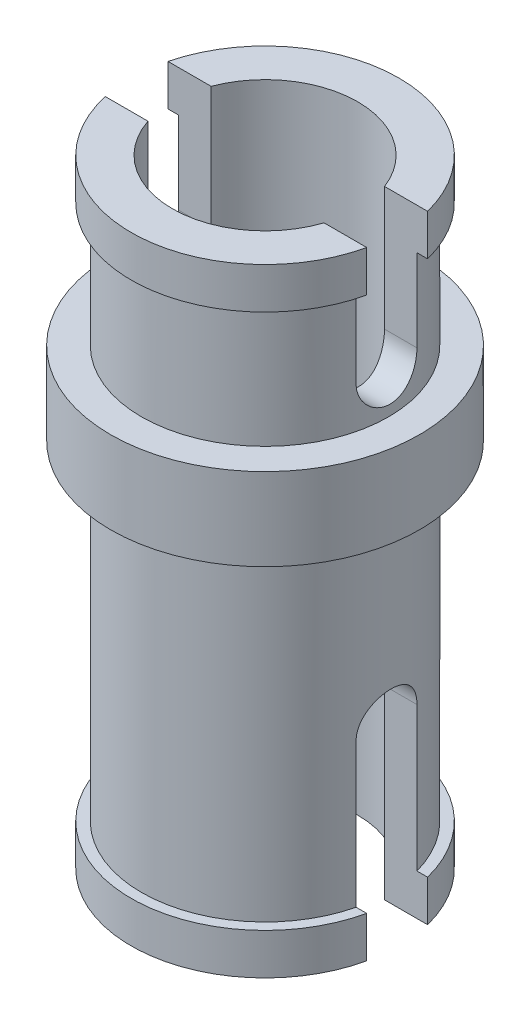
from build123d import *

# Parameters (mm, degrees)
BOSS_EXTRUDE1_DEPTH            = 8
BOSS_EXTRUDE1_DEPTH_BACK       = 8
SKETCH1_R                      = 2.4
BOSS_EXTRUDE2_DEPTH            = 0.8
BOSS_EXTRUDE2_DEPTH_BACK       = 0.8
SKETCH2_R                      = 3
SKETCH4_R                      = 2.6
BOSS_EXTRUDE3_DEPTH            = 0.8
BOSS_EXTRUDE5_START            = -0.8
SKETCH6_R                      = 2.6
BOSS_EXTRUDE5_DEPTH            = 0.8
CUT_EXTRUDE2_REACH             = 18.553
SKETCH7_R                      = 1.8
CUT_EXTRUDE4_REACH             = 11.055
CUT_EXTRUDE4_DIRECTION_2_REACH = 11.055
CUT_EXTRUDE5_DEPTH             = 10.055385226
CUT_EXTRUDE5_DEPTH_BACK        = 10.055385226
SKETCH10_W                     = 7.727405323
SKETCH10_H                     = 7.819898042
BOSS_EXTRUDE6_START            = 3.2
SKETCH11_R                     = 2.4
BOSS_EXTRUDE6_DEPTH            = 3.2
SKETCH13_R                     = 2.6
BOSS_EXTRUDE7_DEPTH            = 0.8
SKETCH12_R                     = 1.8
CUT_EXTRUDE6_DEPTH             = 13.727922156
CUT_EXTRUDE7_DEPTH             = 10.055385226
CUT_EXTRUDE7_DEPTH_BACK        = 10.055385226


with BuildPart() as part:
    # Sketch1 → Boss-Extrude1 (new, two sides: drawn at the far end of the back side and taken through both)
    with BuildSketch(Plane(origin=(0, 0, 0), x_dir=(1, 0, 0), z_dir=(0, 1, 0)).offset(-BOSS_EXTRUDE1_DEPTH_BACK)):
        with Locations(Location((0, 0, 0), (0, 0, 270))):
            Circle(SKETCH1_R)
    extrude(amount=BOSS_EXTRUDE1_DEPTH + BOSS_EXTRUDE1_DEPTH_BACK)

    # Sketch2 → Boss-Extrude2 (add, two sides: drawn at the far end of the back side and taken through both)
    with BuildSketch(Plane(origin=(0, 0, 0), x_dir=(1, 0, 0), z_dir=(0, 1, 0)).offset(-BOSS_EXTRUDE2_DEPTH_BACK)):
        with Locations(Location((0, 0, 0), (0, 0, 270))):
            Circle(SKETCH2_R)
    extrude(amount=BOSS_EXTRUDE2_DEPTH + BOSS_EXTRUDE2_DEPTH_BACK)

    # Sketch4 → Boss-Extrude3 (add)
    with BuildSketch(Plane(origin=(0, 8, 0), x_dir=(1, 0, 0), z_dir=(0, 1, 0))):
        with Locations(Location((0, 0, 0), (0, 0, 270))):
            Circle(SKETCH4_R)
    extrude(amount=-BOSS_EXTRUDE3_DEPTH)

    # Sketch6 → Boss-Extrude5 (add)
    with BuildSketch(Plane.XZ.offset(8).offset(BOSS_EXTRUDE5_START)):
        with Locations(Location((0, 0, 0), (0, 0, 90))):
            Circle(SKETCH6_R)
    extrude(amount=BOSS_EXTRUDE5_DEPTH)

    # Sketch7 → Cut-Extrude2 (cut, up to next)
    with BuildSketch(Plane(origin=(0, 8, 0), x_dir=(1, 0, 0), z_dir=(0, 1, 0)), mode=Mode.PRIVATE) as cut_extrude2_sk1:
        with Locations(Location((0, 0, 0), (0, 0, 270))):
            Circle(SKETCH7_R)
    cut_extrude2_tool1 = extrude(cut_extrude2_sk1.sketch, amount=-CUT_EXTRUDE2_REACH, mode=Mode.PRIVATE) & part.part
    add(cut_extrude2_tool1.solids().sort_by_distance((0, 8, 0))[0], mode=Mode.SUBTRACT)

    # Sketch9 → Cut-Extrude4 (cut, up to next)
    with BuildSketch(Plane(origin=(0, 0, 0), x_dir=(0, 0, -1), z_dir=(1, 0, 0)), mode=Mode.PRIVATE) as cut_extrude4_sk1:
        with BuildLine():
            Line((-0.563999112, 8), (-0.563999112, 4.4))
            ThreePointArc((-0.563999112, 4.4), (0.036000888, 3.8), (0.636000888, 4.4))
            Line((0.636000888, 4.4), (0.636000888, 8))
            Line((0.636000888, 8), (-0.563999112, 8))
        make_face()
    cut_extrude4_tool1 = extrude(cut_extrude4_sk1.sketch, amount=-CUT_EXTRUDE4_REACH, mode=Mode.PRIVATE) & part.part
    # Sketch9 → Cut-Extrude4 (cut, up to next)
    with BuildSketch(Plane(origin=(0, 0, 0), x_dir=(0, 0, -1), z_dir=(1, 0, 0)), mode=Mode.PRIVATE) as cut_extrude4_sk2:
        with BuildLine():
            Line((-0.563999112, -8), (-0.563999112, -4.4))
            ThreePointArc((-0.563999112, -4.4), (0.036000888, -3.8), (0.636000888, -4.4))
            Line((0.636000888, -4.4), (0.636000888, -8))
            Line((0.636000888, -8), (-0.563999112, -8))
        make_face()
    cut_extrude4_tool2 = extrude(cut_extrude4_sk2.sketch, amount=-CUT_EXTRUDE4_REACH, mode=Mode.PRIVATE) & part.part
    add(cut_extrude4_tool1.solids().sort_by_distance((0, 5.962178, -0.036001))[0], mode=Mode.SUBTRACT)
    add(cut_extrude4_tool2.solids().sort_by_distance((0, -5.962178, -0.036001))[0], mode=Mode.SUBTRACT)

    # Sketch9 → Cut-Extrude4 direction 2 (cut, up to next)
    with BuildSketch(Plane(origin=(0, 0, 0), x_dir=(0, 0, -1), z_dir=(1, 0, 0)), mode=Mode.PRIVATE) as cut_extrude4_direction_2_sk1:
        with BuildLine():
            Line((-0.563999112, 8), (-0.563999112, 4.4))
            ThreePointArc((-0.563999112, 4.4), (0.036000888, 3.8), (0.636000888, 4.4))
            Line((0.636000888, 4.4), (0.636000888, 8))
            Line((0.636000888, 8), (-0.563999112, 8))
        make_face()
    cut_extrude4_direction_2_tool1 = extrude(cut_extrude4_direction_2_sk1.sketch, amount=CUT_EXTRUDE4_DIRECTION_2_REACH, mode=Mode.PRIVATE) & part.part
    # Sketch9 → Cut-Extrude4 direction 2 (cut, up to next)
    with BuildSketch(Plane(origin=(0, 0, 0), x_dir=(0, 0, -1), z_dir=(1, 0, 0)), mode=Mode.PRIVATE) as cut_extrude4_direction_2_sk2:
        with BuildLine():
            Line((-0.563999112, -8), (-0.563999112, -4.4))
            ThreePointArc((-0.563999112, -4.4), (0.036000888, -3.8), (0.636000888, -4.4))
            Line((0.636000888, -4.4), (0.636000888, -8))
            Line((0.636000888, -8), (-0.563999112, -8))
        make_face()
    cut_extrude4_direction_2_tool2 = extrude(cut_extrude4_direction_2_sk2.sketch, amount=CUT_EXTRUDE4_DIRECTION_2_REACH, mode=Mode.PRIVATE) & part.part
    add(cut_extrude4_direction_2_tool1.solids().sort_by_distance((0, 5.962178, -0.036001))[0], mode=Mode.SUBTRACT)
    add(cut_extrude4_direction_2_tool2.solids().sort_by_distance((0, -5.962178, -0.036001))[0], mode=Mode.SUBTRACT)

    # Sketch10 → Cut-Extrude5 (cut, two sides: drawn at the far end of the back side and taken through both)
    with BuildSketch(Plane(origin=(0, 0, 0), x_dir=(0, 0, -1), z_dir=(1, 0, 0)).offset(-CUT_EXTRUDE5_DEPTH_BACK)):
        with Locations((0.203352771, 4.709949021)):
            Rectangle(SKETCH10_W, SKETCH10_H)
    extrude(amount=CUT_EXTRUDE5_DEPTH + CUT_EXTRUDE5_DEPTH_BACK, mode=Mode.SUBTRACT)

    # Sketch11 → Boss-Extrude6 (add)
    with BuildSketch(Plane(origin=(0, 0.8, 0), x_dir=(1, 0, 0), z_dir=(0, 1, 0)).offset(BOSS_EXTRUDE6_START)):
        with Locations(Location((0, 0, 0), (0, 0, 270))):
            Circle(SKETCH11_R)
    extrude(amount=-BOSS_EXTRUDE6_DEPTH)

    # Sketch13 → Boss-Extrude7 (add)
    with BuildSketch(Plane(origin=(0, 4, 0), x_dir=(1, 0, 0), z_dir=(0, 1, 0))):
        with Locations(Location((0, 0, 0), (0, 0, 270))):
            Circle(SKETCH13_R)
    extrude(amount=-BOSS_EXTRUDE7_DEPTH)

    # Sketch12 → Cut-Extrude6 (cut, through all)
    with BuildSketch(Plane(origin=(0, 4, 0), x_dir=(1, 0, 0), z_dir=(0, 1, 0))):
        with Locations(Location((0, 0, 0), (0, 0, 270))):
            Circle(SKETCH12_R)
    extrude(amount=-CUT_EXTRUDE6_DEPTH, mode=Mode.SUBTRACT)

    # Sketch14 → Cut-Extrude7 (cut, two sides: drawn at the far end of the back side and taken through both)
    with BuildSketch(Plane(origin=(0, 0, 0), x_dir=(0, 0, -1), z_dir=(1, 0, 0)).offset(-CUT_EXTRUDE7_DEPTH_BACK)):
        with BuildLine():
            Line((-0.563999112, 1.6), (-0.563999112, 4.8))
            Line((-0.563999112, 4.8), (0.636000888, 4.8))
            Line((0.636000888, 4.8), (0.636000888, 1.6))
            ThreePointArc((0.636000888, 1.6), (0.036000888, 1), (-0.563999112, 1.6))
        make_face()
    extrude(amount=CUT_EXTRUDE7_DEPTH + CUT_EXTRUDE7_DEPTH_BACK, mode=Mode.SUBTRACT)


solid = part.part
